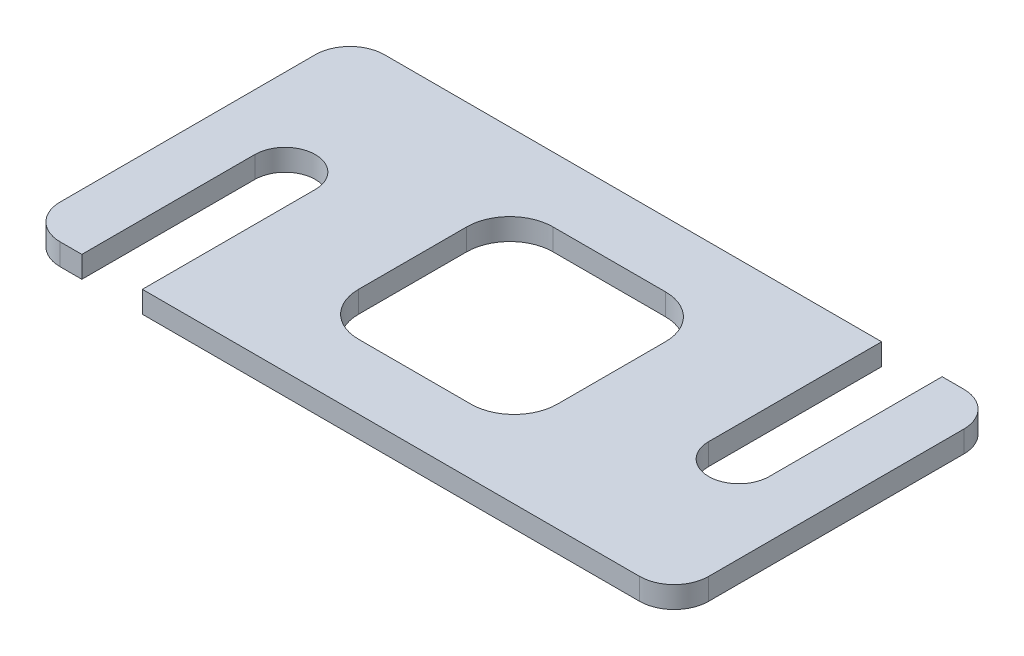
from build123d import *

# Parameters (mm, degrees)
SKETCH1_W           = 150
SKETCH1_H           = 75
BOSS_EXTRUDE1_DEPTH = 5
CUT_EXTRUDE1_DEPTH  = 168.779617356
CUT_EXTRUDE2_DEPTH  = 168.779617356
SKETCH4_W           = 46
SKETCH4_H           = 45
CUT_EXTRUDE3_DEPTH  = 168.779617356
FILLET1_R           = 10
FILLET2_R           = 8


with BuildPart() as part:
    # Sketch1 → Boss-Extrude1 (new body)
    with BuildSketch(Plane(origin=(0, 0, 0), x_dir=(1, 0, 0), z_dir=(0, 1, 0))):
        with Locations((75, 37.5)):
            Rectangle(SKETCH1_W, SKETCH1_H)
    extrude(amount=BOSS_EXTRUDE1_DEPTH)

    # Sketch2 → Cut-Extrude1 (cut, through all)
    with BuildSketch(Plane(origin=(0, 5, 0), x_dir=(1, 0, 0), z_dir=(0, 1, 0))):
        with BuildLine():
            Line((13, 0), (13, 40))
            ThreePointArc((13, 40), (20, 47), (27, 40))
            Line((27, 40), (27, 0))
            Line((27, 0), (13, 0))
        make_face()
    extrude(amount=-CUT_EXTRUDE1_DEPTH, mode=Mode.SUBTRACT)

    # Sketch3 → Cut-Extrude2 (cut, through all)
    with BuildSketch(Plane(origin=(0, 5, 0), x_dir=(1, 0, 0), z_dir=(0, 1, 0))):
        with BuildLine():
            Line((123, 35), (123, 75))
            Line((123, 75), (137, 75))
            Line((137, 75), (137, 35))
            ThreePointArc((137, 35), (130, 28), (123, 35))
        make_face()
    extrude(amount=-CUT_EXTRUDE2_DEPTH, mode=Mode.SUBTRACT)

    # Sketch4 → Cut-Extrude3 (cut, through all)
    with BuildSketch(Plane(origin=(0, 5, 0), x_dir=(1, 0, 0), z_dir=(0, 1, 0))):
        with Locations((75, 37.5)):
            Rectangle(SKETCH4_W, SKETCH4_H)
    extrude(amount=-CUT_EXTRUDE3_DEPTH, mode=Mode.SUBTRACT)

    # Fillet1
    fillet1_edges = [part.edges().sort_by_distance(p)[0] for p in [
        (52, 2.5, -15),
        (52, 2.5, -60),
        (98, 2.5, -60),
        (98, 2.5, -15),
    ]]
    fillet(fillet1_edges, radius=FILLET1_R)

    # Fillet2
    fillet2_edges = [part.edges().sort_by_distance(p)[0] for p in [
        (0, 2.5, -75),
        (150, 2.5, -75),
        (150, 2.5, 0),
        (0, 2.5, 0),
    ]]
    fillet(fillet2_edges, radius=FILLET2_R)


solid = part.part
